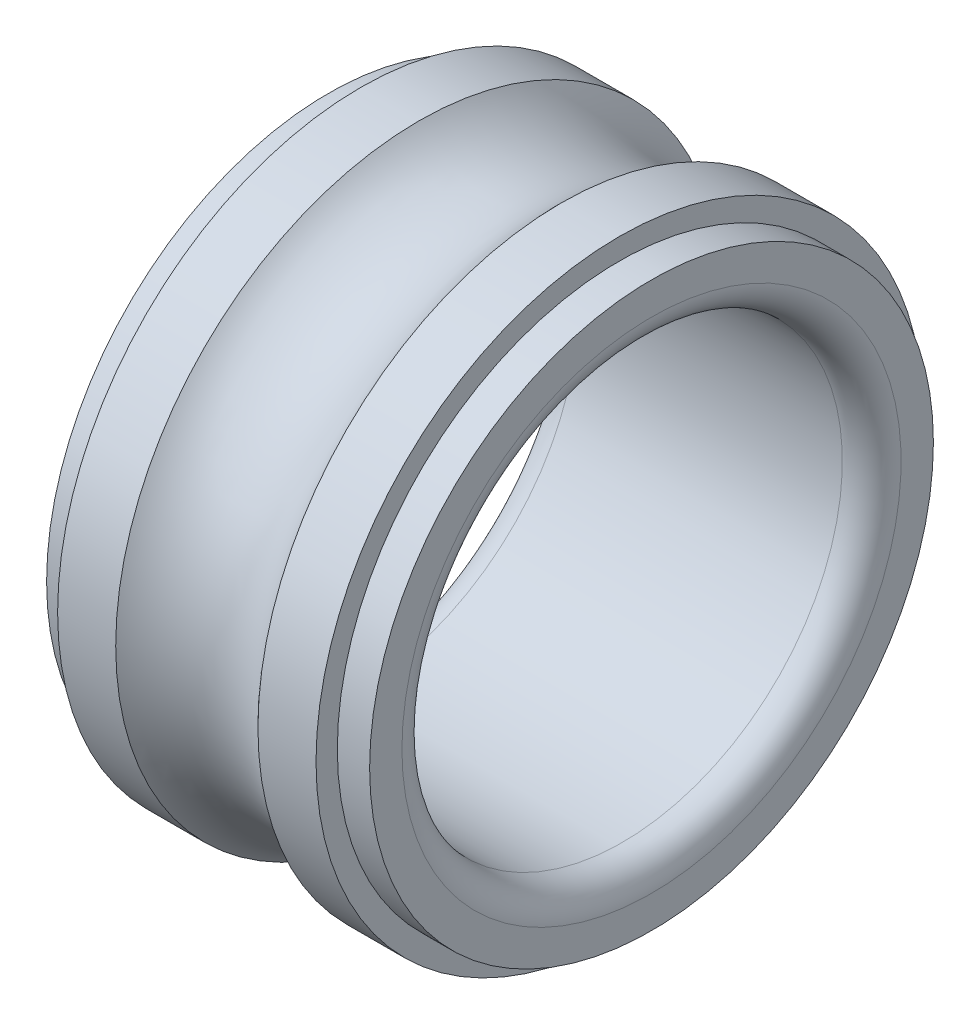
from build123d import *


with BuildPart() as part:
    # Esquisse1 → Base-R_volution (revolve)
    with BuildSketch(Plane.XY, mode=Mode.PRIVATE) as base_r_volution_sk:
        with BuildLine():
            Line((2.421652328, 10.325), (4.4, 10.325))
            Line((4.4, 10.325), (4.4, 9.6))
            Line((4.4, 9.6), (5.5, 9.6))
            Line((5.5, 9.6), (5.5, 8.5))
            ThreePointArc((5.5, 8.5), (5.207106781, 7.792893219), (4.5, 7.5))
            Line((4.5, 7.5), (-4.5, 7.5))
            ThreePointArc((-4.5, 7.5), (-5.207106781, 7.792893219), (-5.5, 8.5))
            Line((-5.5, 8.5), (-5.5, 9.6))
            Line((-5.5, 9.6), (-4.4, 9.6))
            Line((-4.4, 9.6), (-4.4, 10.325))
            Line((-4.4, 10.325), (-2.421652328, 10.325))
            ThreePointArc((-2.421652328, 10.325), (0, 9.245), (2.421652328, 10.325))
        make_face()
    revolve(base_r_volution_sk.sketch.rotate(Axis((-13.974879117, 0, 0), (1, 0, 0)), 90), axis=Axis((-13.974879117, 0, 0), (1, 0, 0)))


solid = part.part
